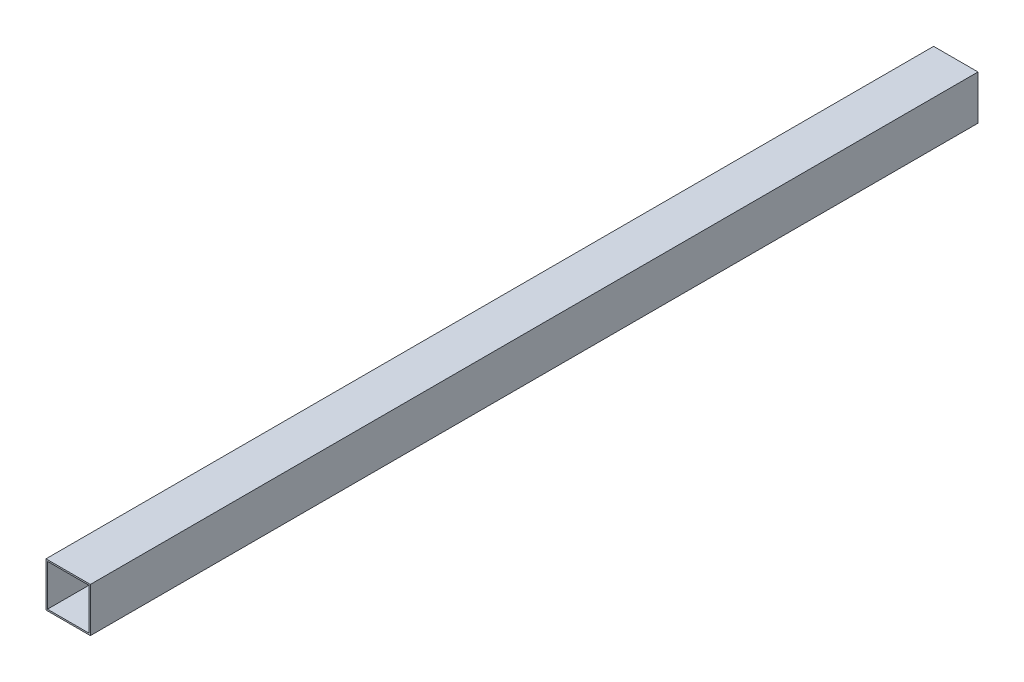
ISO-10303-21;
HEADER;
FILE_DESCRIPTION(('STEP AP214'),'2;1');
FILE_NAME('part.step','',(''),(''),'','','');
FILE_SCHEMA(('AUTOMOTIVE_DESIGN { 1 0 10303 214 1 1 1 1 }'));
ENDSEC;
DATA;
#1=APPLICATION_CONTEXT('core data for automotive mechanical design processes');
#2=APPLICATION_PROTOCOL_DEFINITION('international standard','automotive_design',2000,#1);
#3=PRODUCT_CONTEXT('',#1,'mechanical');
#4=PRODUCT('Part','Part','',(#3));
#5=PRODUCT_RELATED_PRODUCT_CATEGORY('part','',(#4));
#6=PRODUCT_DEFINITION_FORMATION('','',#4);
#7=PRODUCT_DEFINITION_CONTEXT('part definition',#1,'design');
#8=PRODUCT_DEFINITION('design','',#6,#7);
#9=PRODUCT_DEFINITION_SHAPE('','',#8);
#10=(LENGTH_UNIT() NAMED_UNIT(*) SI_UNIT(.MILLI.,.METRE.));
#11=(NAMED_UNIT(*) PLANE_ANGLE_UNIT() SI_UNIT($,.RADIAN.));
#12=(NAMED_UNIT(*) SI_UNIT($,.STERADIAN.) SOLID_ANGLE_UNIT());
#13=UNCERTAINTY_MEASURE_WITH_UNIT(LENGTH_MEASURE(1.E-05),#10,'distance_accuracy_value','');
#14=(GEOMETRIC_REPRESENTATION_CONTEXT(3) GLOBAL_UNCERTAINTY_ASSIGNED_CONTEXT((#13)) GLOBAL_UNIT_ASSIGNED_CONTEXT((#10,
#11,#12)) REPRESENTATION_CONTEXT('',''));
#15=CARTESIAN_POINT('',(0.,0.,0.));
#16=DIRECTION('',(0.,0.,1.));
#17=DIRECTION('',(1.,0.,0.));
#18=AXIS2_PLACEMENT_3D('',#15,#16,#17);
#19=CARTESIAN_POINT('',(1.11022302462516E-13,-6.66133814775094E-13,600.));
#20=DIRECTION('',(0.,0.,1.));
#21=DIRECTION('',(1.,0.,0.));
#22=AXIS2_PLACEMENT_3D('',#19,#20,#21);
#23=PLANE('',#22);
#24=DIRECTION('',(0.,1.,0.));
#25=VECTOR('',#24,1.);
#26=CARTESIAN_POINT('',(15.0000000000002,-15.0000000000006,600.));
#27=LINE('',#26,#25);
#28=CARTESIAN_POINT('',(15.0000000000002,-15.0000000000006,600.));
#29=VERTEX_POINT('',#28);
#30=CARTESIAN_POINT('',(15.0000000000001,14.9999999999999,600.));
#31=VERTEX_POINT('',#30);
#32=EDGE_CURVE('E162',#29,#31,#27,.T.);
#33=ORIENTED_EDGE('',*,*,#32,.T.);
#34=DIRECTION('',(-1.,0.,0.));
#35=VECTOR('',#34,1.);
#36=CARTESIAN_POINT('',(-15.,14.9999999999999,600.));
#37=LINE('',#36,#35);
#38=CARTESIAN_POINT('',(-15.,14.9999999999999,600.));
#39=VERTEX_POINT('',#38);
#40=EDGE_CURVE('E165',#31,#39,#37,.T.);
#41=ORIENTED_EDGE('',*,*,#40,.T.);
#42=DIRECTION('',(0.,-1.,0.));
#43=VECTOR('',#42,1.);
#44=CARTESIAN_POINT('',(-14.9999999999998,-15.0000000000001,600.));
#45=LINE('',#44,#43);
#46=CARTESIAN_POINT('',(-14.9999999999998,-15.0000000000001,600.));
#47=VERTEX_POINT('',#46);
#48=EDGE_CURVE('E168',#39,#47,#45,.T.);
#49=ORIENTED_EDGE('',*,*,#48,.T.);
#50=DIRECTION('',(1.,0.,0.));
#51=VECTOR('',#50,1.);
#52=CARTESIAN_POINT('',(-14.9999999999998,-15.0000000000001,600.));
#53=LINE('',#52,#51);
#54=EDGE_CURVE('E170',#47,#29,#53,.T.);
#55=ORIENTED_EDGE('',*,*,#54,.T.);
#56=EDGE_LOOP('',(#33,#41,#49,#55));
#57=FACE_BOUND('',#56,.T.);
#58=DIRECTION('',(-1.,0.,0.));
#59=VECTOR('',#58,1.);
#60=CARTESIAN_POINT('',(0.,13.9999999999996,600.));
#61=LINE('',#60,#59);
#62=CARTESIAN_POINT('',(14.0000000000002,14.,600.));
#63=VERTEX_POINT('',#62);
#64=CARTESIAN_POINT('',(-13.9999999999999,14.0000000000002,600.));
#65=VERTEX_POINT('',#64);
#66=EDGE_CURVE('E134',#63,#65,#61,.T.);
#67=ORIENTED_EDGE('',*,*,#66,.F.);
#68=DIRECTION('',(0.,1.,0.));
#69=VECTOR('',#68,1.);
#70=CARTESIAN_POINT('',(14.0000000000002,-2.22044604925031E-13,600.));
#71=LINE('',#70,#69);
#72=CARTESIAN_POINT('',(14.,-14.,600.));
#73=VERTEX_POINT('',#72);
#74=EDGE_CURVE('E126',#73,#63,#71,.T.);
#75=ORIENTED_EDGE('',*,*,#74,.F.);
#76=DIRECTION('',(1.,0.,0.));
#77=VECTOR('',#76,1.);
#78=CARTESIAN_POINT('',(1.11022302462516E-13,-13.9999999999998,600.));
#79=LINE('',#78,#77);
#80=CARTESIAN_POINT('',(-13.9999999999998,-14.,600.));
#81=VERTEX_POINT('',#80);
#82=EDGE_CURVE('E148',#81,#73,#79,.T.);
#83=ORIENTED_EDGE('',*,*,#82,.F.);
#84=DIRECTION('',(0.,-1.,0.));
#85=VECTOR('',#84,1.);
#86=CARTESIAN_POINT('',(-14.0000000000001,2.22044604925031E-13,600.));
#87=LINE('',#86,#85);
#88=EDGE_CURVE('E146',#65,#81,#87,.T.);
#89=ORIENTED_EDGE('',*,*,#88,.F.);
#90=EDGE_LOOP('',(#67,#75,#83,#89));
#91=FACE_BOUND('',#90,.T.);
#92=ADVANCED_FACE('F60',(#57,#91),#23,.T.);
#93=CARTESIAN_POINT('',(0.,0.,0.));
#94=DIRECTION('',(0.,0.,1.));
#95=DIRECTION('',(1.,0.,0.));
#96=AXIS2_PLACEMENT_3D('',#93,#94,#95);
#97=PLANE('',#96);
#98=DIRECTION('',(0.,1.,0.));
#99=VECTOR('',#98,1.);
#100=CARTESIAN_POINT('',(15.0000000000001,-15.0000000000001,0.));
#101=LINE('',#100,#99);
#102=CARTESIAN_POINT('',(15.0000000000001,-15.0000000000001,0.));
#103=VERTEX_POINT('',#102);
#104=CARTESIAN_POINT('',(15.0000000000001,14.9999999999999,1.66533453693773E-13));
#105=VERTEX_POINT('',#104);
#106=EDGE_CURVE('E142',#103,#105,#101,.T.);
#107=ORIENTED_EDGE('',*,*,#106,.F.);
#108=DIRECTION('',(1.,0.,0.));
#109=VECTOR('',#108,1.);
#110=CARTESIAN_POINT('',(-15.,-14.9999999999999,1.11022302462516E-13));
#111=LINE('',#110,#109);
#112=CARTESIAN_POINT('',(-15.,-14.9999999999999,1.11022302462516E-13));
#113=VERTEX_POINT('',#112);
#114=EDGE_CURVE('E166',#113,#103,#111,.T.);
#115=ORIENTED_EDGE('',*,*,#114,.F.);
#116=DIRECTION('',(0.,-1.,0.));
#117=VECTOR('',#116,1.);
#118=CARTESIAN_POINT('',(-15.,-14.9999999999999,1.11022302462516E-13));
#119=LINE('',#118,#117);
#120=CARTESIAN_POINT('',(-15.,15.0000000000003,0.));
#121=VERTEX_POINT('',#120);
#122=EDGE_CURVE('E177',#121,#113,#119,.T.);
#123=ORIENTED_EDGE('',*,*,#122,.F.);
#124=DIRECTION('',(-1.,0.,0.));
#125=VECTOR('',#124,1.);
#126=CARTESIAN_POINT('',(-15.,15.0000000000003,0.));
#127=LINE('',#126,#125);
#128=EDGE_CURVE('E175',#105,#121,#127,.T.);
#129=ORIENTED_EDGE('',*,*,#128,.F.);
#130=EDGE_LOOP('',(#107,#115,#123,#129));
#131=FACE_BOUND('',#130,.T.);
#132=DIRECTION('',(0.,1.,0.));
#133=VECTOR('',#132,1.);
#134=CARTESIAN_POINT('',(14.0000000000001,-2.22044604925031E-13,1.66533453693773E-13));
#135=LINE('',#134,#133);
#136=CARTESIAN_POINT('',(14.0000000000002,-14.,0.));
#137=VERTEX_POINT('',#136);
#138=CARTESIAN_POINT('',(14.,14.0000000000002,0.));
#139=VERTEX_POINT('',#138);
#140=EDGE_CURVE('E84',#137,#139,#135,.T.);
#141=ORIENTED_EDGE('',*,*,#140,.T.);
#142=DIRECTION('',(-1.,0.,0.));
#143=VECTOR('',#142,1.);
#144=CARTESIAN_POINT('',(0.,14.0000000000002,0.));
#145=LINE('',#144,#143);
#146=CARTESIAN_POINT('',(-13.9999999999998,13.9999999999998,0.));
#147=VERTEX_POINT('',#146);
#148=EDGE_CURVE('E141',#139,#147,#145,.T.);
#149=ORIENTED_EDGE('',*,*,#148,.T.);
#150=DIRECTION('',(0.,-1.,0.));
#151=VECTOR('',#150,1.);
#152=CARTESIAN_POINT('',(-13.9999999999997,-2.22044604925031E-13,0.));
#153=LINE('',#152,#151);
#154=CARTESIAN_POINT('',(-14.,-14.,0.));
#155=VERTEX_POINT('',#154);
#156=EDGE_CURVE('E154',#147,#155,#153,.T.);
#157=ORIENTED_EDGE('',*,*,#156,.T.);
#158=DIRECTION('',(1.,0.,0.));
#159=VECTOR('',#158,1.);
#160=CARTESIAN_POINT('',(1.66533453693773E-13,-14.,0.));
#161=LINE('',#160,#159);
#162=EDGE_CURVE('E135',#155,#137,#161,.T.);
#163=ORIENTED_EDGE('',*,*,#162,.T.);
#164=EDGE_LOOP('',(#141,#149,#157,#163));
#165=FACE_BOUND('',#164,.T.);
#166=ADVANCED_FACE('F195',(#131,#165),#97,.F.);
#167=CARTESIAN_POINT('',(15.0000000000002,-15.0000000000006,600.));
#168=DIRECTION('',(-1.,0.,0.));
#169=DIRECTION('',(0.,0.,1.));
#170=AXIS2_PLACEMENT_3D('',#167,#168,#169);
#171=PLANE('',#170);
#172=ORIENTED_EDGE('',*,*,#106,.T.);
#173=DIRECTION('',(0.,0.,-1.));
#174=VECTOR('',#173,1.);
#175=CARTESIAN_POINT('',(15.0000000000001,14.9999999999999,600.));
#176=LINE('',#175,#174);
#177=EDGE_CURVE('E13',#31,#105,#176,.T.);
#178=ORIENTED_EDGE('',*,*,#177,.F.);
#179=ORIENTED_EDGE('',*,*,#32,.F.);
#180=DIRECTION('',(0.,0.,-1.));
#181=VECTOR('',#180,1.);
#182=CARTESIAN_POINT('',(15.0000000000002,-15.0000000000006,600.));
#183=LINE('',#182,#181);
#184=EDGE_CURVE('E172',#29,#103,#183,.T.);
#185=ORIENTED_EDGE('',*,*,#184,.T.);
#186=EDGE_LOOP('',(#172,#178,#179,#185));
#187=FACE_BOUND('',#186,.T.);
#188=ADVANCED_FACE('F62',(#187),#171,.F.);
#189=CARTESIAN_POINT('',(-15.,14.9999999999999,600.));
#190=DIRECTION('',(0.,-1.,0.));
#191=DIRECTION('',(0.,0.,-1.));
#192=AXIS2_PLACEMENT_3D('',#189,#190,#191);
#193=PLANE('',#192);
#194=ORIENTED_EDGE('',*,*,#128,.T.);
#195=DIRECTION('',(0.,0.,-1.));
#196=VECTOR('',#195,1.);
#197=CARTESIAN_POINT('',(-15.,14.9999999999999,600.));
#198=LINE('',#197,#196);
#199=EDGE_CURVE('E69',#39,#121,#198,.T.);
#200=ORIENTED_EDGE('',*,*,#199,.F.);
#201=ORIENTED_EDGE('',*,*,#40,.F.);
#202=ORIENTED_EDGE('',*,*,#177,.T.);
#203=EDGE_LOOP('',(#194,#200,#201,#202));
#204=FACE_BOUND('',#203,.T.);
#205=ADVANCED_FACE('F205',(#204),#193,.F.);
#206=CARTESIAN_POINT('',(-14.9999999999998,-15.0000000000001,600.));
#207=DIRECTION('',(1.,0.,0.));
#208=DIRECTION('',(0.,0.,-1.));
#209=AXIS2_PLACEMENT_3D('',#206,#207,#208);
#210=PLANE('',#209);
#211=ORIENTED_EDGE('',*,*,#122,.T.);
#212=DIRECTION('',(0.,0.,-1.));
#213=VECTOR('',#212,1.);
#214=CARTESIAN_POINT('',(-14.9999999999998,-15.0000000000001,600.));
#215=LINE('',#214,#213);
#216=EDGE_CURVE('E182',#47,#113,#215,.T.);
#217=ORIENTED_EDGE('',*,*,#216,.F.);
#218=ORIENTED_EDGE('',*,*,#48,.F.);
#219=ORIENTED_EDGE('',*,*,#199,.T.);
#220=EDGE_LOOP('',(#211,#217,#218,#219));
#221=FACE_BOUND('',#220,.T.);
#222=ADVANCED_FACE('F189',(#221),#210,.F.);
#223=CARTESIAN_POINT('',(-14.9999999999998,-15.0000000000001,600.));
#224=DIRECTION('',(0.,1.,0.));
#225=DIRECTION('',(0.,0.,1.));
#226=AXIS2_PLACEMENT_3D('',#223,#224,#225);
#227=PLANE('',#226);
#228=ORIENTED_EDGE('',*,*,#114,.T.);
#229=ORIENTED_EDGE('',*,*,#184,.F.);
#230=ORIENTED_EDGE('',*,*,#54,.F.);
#231=ORIENTED_EDGE('',*,*,#216,.T.);
#232=EDGE_LOOP('',(#228,#229,#230,#231));
#233=FACE_BOUND('',#232,.T.);
#234=ADVANCED_FACE('F199',(#233),#227,.F.);
#235=CARTESIAN_POINT('',(14.0000000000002,-2.22044604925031E-13,600.));
#236=DIRECTION('',(-1.,0.,0.));
#237=DIRECTION('',(0.,0.,1.));
#238=AXIS2_PLACEMENT_3D('',#235,#236,#237);
#239=PLANE('',#238);
#240=ORIENTED_EDGE('',*,*,#140,.F.);
#241=DIRECTION('',(0.,0.,-1.));
#242=VECTOR('',#241,1.);
#243=CARTESIAN_POINT('',(14.,-14.,600.));
#244=LINE('',#243,#242);
#245=EDGE_CURVE('E130',#73,#137,#244,.T.);
#246=ORIENTED_EDGE('',*,*,#245,.F.);
#247=ORIENTED_EDGE('',*,*,#74,.T.);
#248=DIRECTION('',(0.,0.,-1.));
#249=VECTOR('',#248,1.);
#250=CARTESIAN_POINT('',(14.0000000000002,14.,600.));
#251=LINE('',#250,#249);
#252=EDGE_CURVE('E129',#63,#139,#251,.T.);
#253=ORIENTED_EDGE('',*,*,#252,.T.);
#254=EDGE_LOOP('',(#240,#246,#247,#253));
#255=FACE_BOUND('',#254,.T.);
#256=ADVANCED_FACE('F128',(#255),#239,.T.);
#257=CARTESIAN_POINT('',(0.,13.9999999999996,600.));
#258=DIRECTION('',(0.,-1.,0.));
#259=DIRECTION('',(0.,0.,-1.));
#260=AXIS2_PLACEMENT_3D('',#257,#258,#259);
#261=PLANE('',#260);
#262=ORIENTED_EDGE('',*,*,#148,.F.);
#263=ORIENTED_EDGE('',*,*,#252,.F.);
#264=ORIENTED_EDGE('',*,*,#66,.T.);
#265=DIRECTION('',(0.,0.,-1.));
#266=VECTOR('',#265,1.);
#267=CARTESIAN_POINT('',(-13.9999999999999,14.0000000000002,600.));
#268=LINE('',#267,#266);
#269=EDGE_CURVE('E143',#65,#147,#268,.T.);
#270=ORIENTED_EDGE('',*,*,#269,.T.);
#271=EDGE_LOOP('',(#262,#263,#264,#270));
#272=FACE_BOUND('',#271,.T.);
#273=ADVANCED_FACE('F138',(#272),#261,.T.);
#274=CARTESIAN_POINT('',(-14.0000000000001,2.22044604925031E-13,600.));
#275=DIRECTION('',(1.,0.,0.));
#276=DIRECTION('',(0.,0.,-1.));
#277=AXIS2_PLACEMENT_3D('',#274,#275,#276);
#278=PLANE('',#277);
#279=ORIENTED_EDGE('',*,*,#156,.F.);
#280=ORIENTED_EDGE('',*,*,#269,.F.);
#281=ORIENTED_EDGE('',*,*,#88,.T.);
#282=DIRECTION('',(0.,0.,-1.));
#283=VECTOR('',#282,1.);
#284=CARTESIAN_POINT('',(-13.9999999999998,-14.,600.));
#285=LINE('',#284,#283);
#286=EDGE_CURVE('E76',#81,#155,#285,.T.);
#287=ORIENTED_EDGE('',*,*,#286,.T.);
#288=EDGE_LOOP('',(#279,#280,#281,#287));
#289=FACE_BOUND('',#288,.T.);
#290=ADVANCED_FACE('F228',(#289),#278,.T.);
#291=CARTESIAN_POINT('',(1.11022302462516E-13,-13.9999999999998,600.));
#292=DIRECTION('',(0.,1.,0.));
#293=DIRECTION('',(0.,0.,1.));
#294=AXIS2_PLACEMENT_3D('',#291,#292,#293);
#295=PLANE('',#294);
#296=ORIENTED_EDGE('',*,*,#162,.F.);
#297=ORIENTED_EDGE('',*,*,#286,.F.);
#298=ORIENTED_EDGE('',*,*,#82,.T.);
#299=ORIENTED_EDGE('',*,*,#245,.T.);
#300=EDGE_LOOP('',(#296,#297,#298,#299));
#301=FACE_BOUND('',#300,.T.);
#302=ADVANCED_FACE('F232',(#301),#295,.T.);
#303=CLOSED_SHELL('',(#92,#166,#188,#205,#222,#234,#256,#273,#290,#302));
#304=MANIFOLD_SOLID_BREP('B2',#303);
#305=ADVANCED_BREP_SHAPE_REPRESENTATION('',(#18,#304),#14);
#306=SHAPE_DEFINITION_REPRESENTATION(#9,#305);
ENDSEC;
END-ISO-10303-21;
